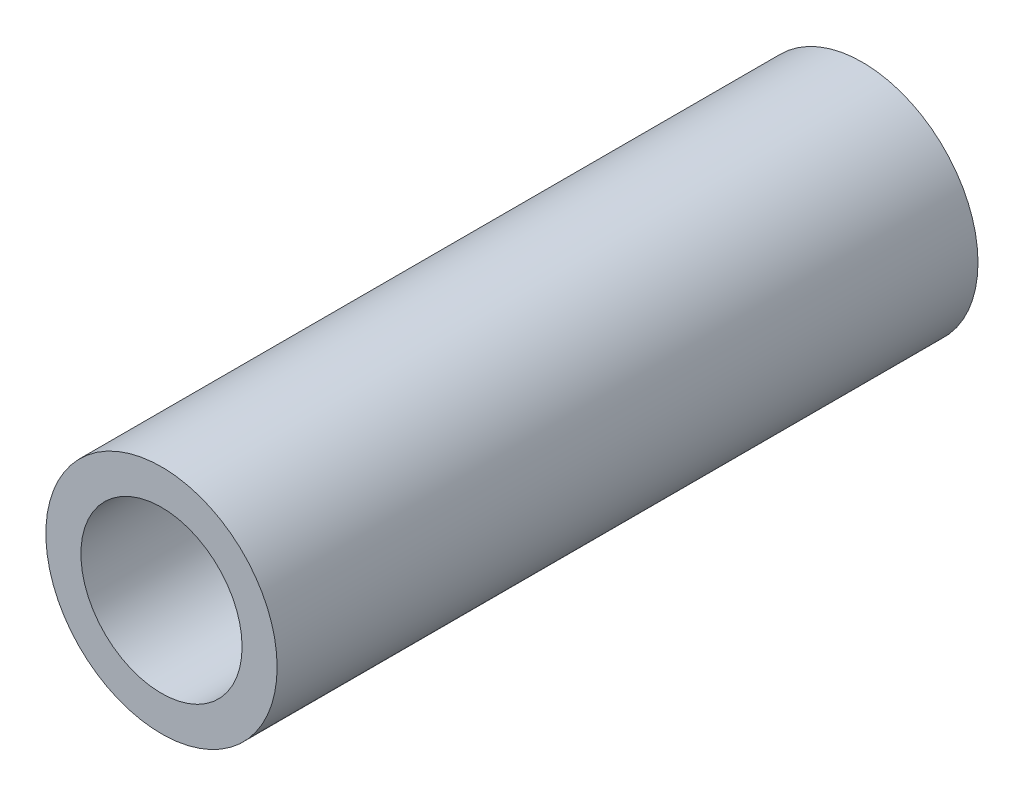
ISO-10303-21;
HEADER;
FILE_DESCRIPTION(('STEP AP214'),'2;1');
FILE_NAME('part.step','',(''),(''),'','','');
FILE_SCHEMA(('AUTOMOTIVE_DESIGN { 1 0 10303 214 1 1 1 1 }'));
ENDSEC;
DATA;
#1=APPLICATION_CONTEXT('core data for automotive mechanical design processes');
#2=APPLICATION_PROTOCOL_DEFINITION('international standard','automotive_design',2000,#1);
#3=PRODUCT_CONTEXT('',#1,'mechanical');
#4=PRODUCT('Part','Part','',(#3));
#5=PRODUCT_RELATED_PRODUCT_CATEGORY('part','',(#4));
#6=PRODUCT_DEFINITION_FORMATION('','',#4);
#7=PRODUCT_DEFINITION_CONTEXT('part definition',#1,'design');
#8=PRODUCT_DEFINITION('design','',#6,#7);
#9=PRODUCT_DEFINITION_SHAPE('','',#8);
#10=(LENGTH_UNIT() NAMED_UNIT(*) SI_UNIT(.MILLI.,.METRE.));
#11=(NAMED_UNIT(*) PLANE_ANGLE_UNIT() SI_UNIT($,.RADIAN.));
#12=(NAMED_UNIT(*) SI_UNIT($,.STERADIAN.) SOLID_ANGLE_UNIT());
#13=UNCERTAINTY_MEASURE_WITH_UNIT(LENGTH_MEASURE(1.E-05),#10,'distance_accuracy_value','');
#14=(GEOMETRIC_REPRESENTATION_CONTEXT(3) GLOBAL_UNCERTAINTY_ASSIGNED_CONTEXT((#13)) GLOBAL_UNIT_ASSIGNED_CONTEXT((#10,
#11,#12)) REPRESENTATION_CONTEXT('',''));
#15=CARTESIAN_POINT('',(0.,0.,0.));
#16=DIRECTION('',(0.,0.,1.));
#17=DIRECTION('',(1.,0.,0.));
#18=AXIS2_PLACEMENT_3D('',#15,#16,#17);
#19=CARTESIAN_POINT('',(0.,0.,200.));
#20=DIRECTION('',(0.,0.,1.));
#21=DIRECTION('',(1.,0.,0.));
#22=AXIS2_PLACEMENT_3D('',#19,#20,#21);
#23=PLANE('',#22);
#24=CARTESIAN_POINT('',(0.,0.,200.));
#25=DIRECTION('',(0.,0.,1.));
#26=DIRECTION('',(1.,0.,0.));
#27=AXIS2_PLACEMENT_3D('',#24,#25,#26);
#28=CIRCLE('',#27,33.);
#29=CARTESIAN_POINT('',(33.,0.,200.));
#30=VERTEX_POINT('',#29);
#31=EDGE_CURVE('E10',#30,#30,#28,.T.);
#32=ORIENTED_EDGE('',*,*,#31,.T.);
#33=EDGE_LOOP('',(#32));
#34=FACE_BOUND('',#33,.T.);
#35=CARTESIAN_POINT('',(0.,0.,200.));
#36=DIRECTION('',(0.,0.,1.));
#37=DIRECTION('',(1.,0.,0.));
#38=AXIS2_PLACEMENT_3D('',#35,#36,#37);
#39=CIRCLE('',#38,23.);
#40=CARTESIAN_POINT('',(23.,0.,200.));
#41=VERTEX_POINT('',#40);
#42=EDGE_CURVE('E54',#41,#41,#39,.T.);
#43=ORIENTED_EDGE('',*,*,#42,.F.);
#44=EDGE_LOOP('',(#43));
#45=FACE_BOUND('',#44,.T.);
#46=ADVANCED_FACE('F43',(#34,#45),#23,.T.);
#47=CARTESIAN_POINT('',(0.,0.,0.));
#48=DIRECTION('',(0.,0.,1.));
#49=DIRECTION('',(1.,0.,0.));
#50=AXIS2_PLACEMENT_3D('',#47,#48,#49);
#51=PLANE('',#50);
#52=CARTESIAN_POINT('',(0.,0.,0.));
#53=DIRECTION('',(0.,0.,1.));
#54=DIRECTION('',(1.,0.,0.));
#55=AXIS2_PLACEMENT_3D('',#52,#53,#54);
#56=CIRCLE('',#55,33.);
#57=CARTESIAN_POINT('',(33.,0.,0.));
#58=VERTEX_POINT('',#57);
#59=EDGE_CURVE('E50',#58,#58,#56,.T.);
#60=ORIENTED_EDGE('',*,*,#59,.F.);
#61=EDGE_LOOP('',(#60));
#62=FACE_BOUND('',#61,.T.);
#63=CARTESIAN_POINT('',(0.,0.,0.));
#64=DIRECTION('',(0.,0.,1.));
#65=DIRECTION('',(1.,0.,0.));
#66=AXIS2_PLACEMENT_3D('',#63,#64,#65);
#67=CIRCLE('',#66,23.);
#68=CARTESIAN_POINT('',(23.,0.,0.));
#69=VERTEX_POINT('',#68);
#70=EDGE_CURVE('E58',#69,#69,#67,.T.);
#71=ORIENTED_EDGE('',*,*,#70,.T.);
#72=EDGE_LOOP('',(#71));
#73=FACE_BOUND('',#72,.T.);
#74=ADVANCED_FACE('F64',(#62,#73),#51,.F.);
#75=CARTESIAN_POINT('',(0.,0.,200.));
#76=DIRECTION('',(0.,0.,-1.));
#77=DIRECTION('',(-1.,0.,0.));
#78=AXIS2_PLACEMENT_3D('',#75,#76,#77);
#79=CYLINDRICAL_SURFACE('',#78,33.);
#80=ORIENTED_EDGE('',*,*,#31,.F.);
#81=EDGE_LOOP('',(#80));
#82=FACE_BOUND('',#81,.T.);
#83=ORIENTED_EDGE('',*,*,#59,.T.);
#84=EDGE_LOOP('',(#83));
#85=FACE_BOUND('',#84,.T.);
#86=ADVANCED_FACE('F45',(#82,#85),#79,.T.);
#87=CARTESIAN_POINT('',(0.,0.,200.));
#88=DIRECTION('',(0.,0.,-1.));
#89=DIRECTION('',(-1.,0.,0.));
#90=AXIS2_PLACEMENT_3D('',#87,#88,#89);
#91=CYLINDRICAL_SURFACE('',#90,23.);
#92=ORIENTED_EDGE('',*,*,#42,.T.);
#93=EDGE_LOOP('',(#92));
#94=FACE_BOUND('',#93,.T.);
#95=ORIENTED_EDGE('',*,*,#70,.F.);
#96=EDGE_LOOP('',(#95));
#97=FACE_BOUND('',#96,.T.);
#98=ADVANCED_FACE('F66',(#94,#97),#91,.F.);
#99=CLOSED_SHELL('',(#46,#74,#86,#98));
#100=MANIFOLD_SOLID_BREP('B2',#99);
#101=ADVANCED_BREP_SHAPE_REPRESENTATION('',(#18,#100),#14);
#102=SHAPE_DEFINITION_REPRESENTATION(#9,#101);
ENDSEC;
END-ISO-10303-21;
